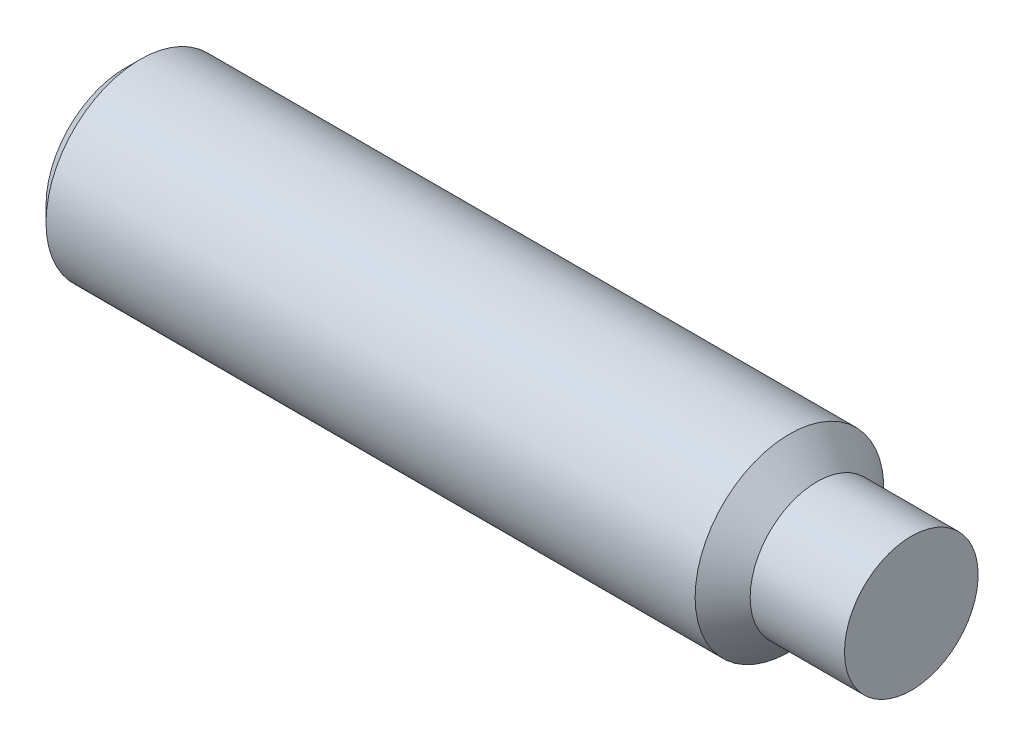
from build123d import *

# Parameters (mm, degrees)
COUNTERSINK_DEPTH = 8


with BuildPart() as part:
    # BodySke → BaseBody (revolve)
    with BuildSketch(Plane.XY, mode=Mode.PRIVATE) as basebody_sk:
        Polygon((0, 0), (0, 5.036), (0.964, 6), (42.25, 6), (44, 4.25), (50, 4.25), (50, 0), align=None)
    revolve(basebody_sk.sketch.rotate(Axis((0, 0, 0), (1, 0, 0)), 90), axis=Axis((0, 0, 0), (1, 0, 0)))

    # CountersinkSke → Countersink (cut)
    with BuildSketch(Plane(origin=(0, 0, 0), x_dir=(0, 0, -1), z_dir=(1, 0, 0))):
        Polygon((0, 3.464101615), (-3, 1.732050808), (-3, -1.732050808), (0, -3.464101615), (3, -1.732050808), (3, 1.732050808), align=None)
    extrude(amount=COUNTERSINK_DEPTH, mode=Mode.SUBTRACT)


solid = part.part
